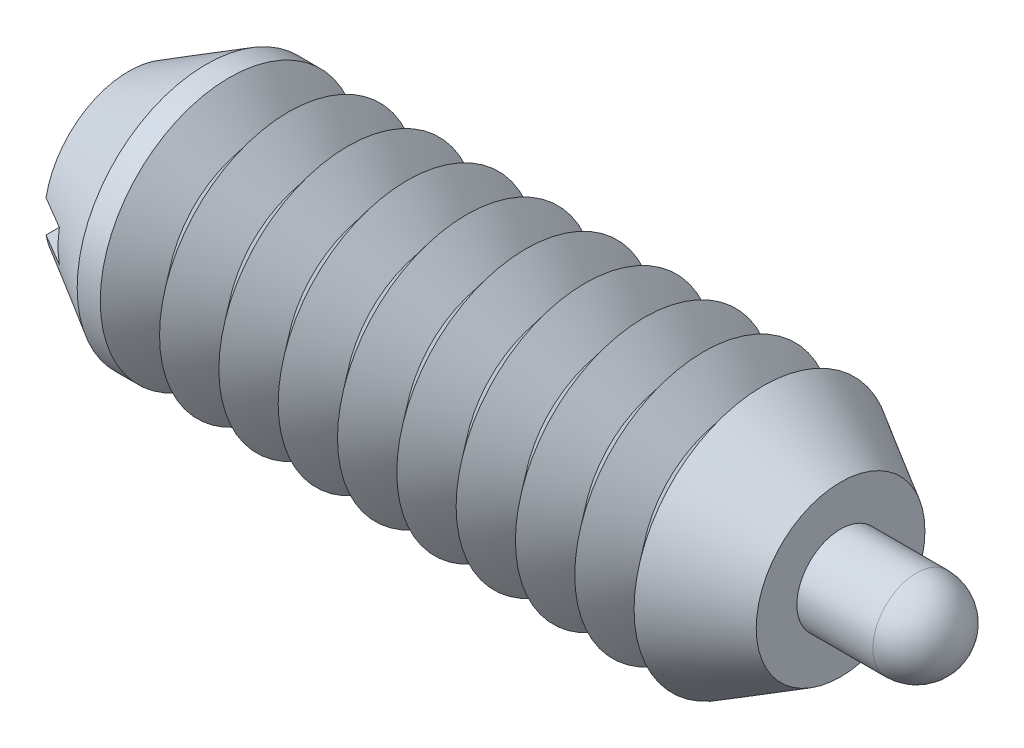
ISO-10303-21;
HEADER;
FILE_DESCRIPTION(('STEP AP214'),'2;1');
FILE_NAME('part.step','',(''),(''),'','','');
FILE_SCHEMA(('AUTOMOTIVE_DESIGN { 1 0 10303 214 1 1 1 1 }'));
ENDSEC;
DATA;
#1=APPLICATION_CONTEXT('core data for automotive mechanical design processes');
#2=APPLICATION_PROTOCOL_DEFINITION('international standard','automotive_design',2000,#1);
#3=PRODUCT_CONTEXT('',#1,'mechanical');
#4=PRODUCT('Part','Part','',(#3));
#5=PRODUCT_RELATED_PRODUCT_CATEGORY('part','',(#4));
#6=PRODUCT_DEFINITION_FORMATION('','',#4);
#7=PRODUCT_DEFINITION_CONTEXT('part definition',#1,'design');
#8=PRODUCT_DEFINITION('design','',#6,#7);
#9=PRODUCT_DEFINITION_SHAPE('','',#8);
#10=(LENGTH_UNIT() NAMED_UNIT(*) SI_UNIT(.MILLI.,.METRE.));
#11=(NAMED_UNIT(*) PLANE_ANGLE_UNIT() SI_UNIT($,.RADIAN.));
#12=(NAMED_UNIT(*) SI_UNIT($,.STERADIAN.) SOLID_ANGLE_UNIT());
#13=UNCERTAINTY_MEASURE_WITH_UNIT(LENGTH_MEASURE(1.E-05),#10,'distance_accuracy_value','');
#14=(GEOMETRIC_REPRESENTATION_CONTEXT(3) GLOBAL_UNCERTAINTY_ASSIGNED_CONTEXT((#13)) GLOBAL_UNIT_ASSIGNED_CONTEXT((#10,
#11,#12)) REPRESENTATION_CONTEXT('',''));
#15=CARTESIAN_POINT('',(0.,0.,0.));
#16=DIRECTION('',(0.,0.,1.));
#17=DIRECTION('',(1.,0.,0.));
#18=AXIS2_PLACEMENT_3D('',#15,#16,#17);
#19=CARTESIAN_POINT('',(8.18134,0.,0.));
#20=DIRECTION('',(-1.,0.,0.));
#21=DIRECTION('',(0.,-0.719424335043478,-0.694570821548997));
#22=AXIS2_PLACEMENT_3D('',#19,#20,#21);
#23=PLANE('',#22);
#24=CARTESIAN_POINT('',(8.18134,0.,0.));
#25=DIRECTION('',(1.,0.,0.));
#26=DIRECTION('',(0.,0.719424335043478,0.694570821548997));
#27=AXIS2_PLACEMENT_3D('',#24,#25,#26);
#28=CIRCLE('',#27,0.5842);
#29=CARTESIAN_POINT('',(8.18134,0.4202876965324,0.405768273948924));
#30=VERTEX_POINT('',#29);
#31=EDGE_CURVE('P0_E10',#30,#30,#28,.T.);
#32=ORIENTED_EDGE('',*,*,#31,.F.);
#33=EDGE_LOOP('',(#32));
#34=FACE_BOUND('',#33,.T.);
#35=ADVANCED_FACE('P0_F14',(#34),#23,.T.);
#36=CARTESIAN_POINT('',(8.29818,0.,0.));
#37=DIRECTION('',(1.,0.,0.));
#38=DIRECTION('',(0.,0.719424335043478,0.694570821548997));
#39=AXIS2_PLACEMENT_3D('',#36,#37,#38);
#40=CONICAL_SURFACE('',#39,0.70104,0.785398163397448);
#41=ORIENTED_EDGE('',*,*,#31,.T.);
#42=EDGE_LOOP('',(#41));
#43=FACE_BOUND('',#42,.T.);
#44=CARTESIAN_POINT('',(8.29818,0.,0.));
#45=DIRECTION('',(1.,0.,0.));
#46=DIRECTION('',(0.,0.719424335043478,0.694570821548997));
#47=AXIS2_PLACEMENT_3D('',#44,#45,#46);
#48=CIRCLE('',#47,0.70104);
#49=CARTESIAN_POINT('',(8.29818,0.50434523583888,0.486921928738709));
#50=VERTEX_POINT('',#49);
#51=EDGE_CURVE('P0_E20',#50,#50,#48,.T.);
#52=ORIENTED_EDGE('',*,*,#51,.F.);
#53=EDGE_LOOP('',(#52));
#54=FACE_BOUND('',#53,.T.);
#55=ADVANCED_FACE('P0_F54',(#43,#54),#40,.T.);
#56=CARTESIAN_POINT('',(11.1252,0.,0.));
#57=DIRECTION('',(1.,0.,0.));
#58=DIRECTION('',(0.,0.719424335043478,0.694570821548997));
#59=AXIS2_PLACEMENT_3D('',#56,#57,#58);
#60=CYLINDRICAL_SURFACE('',#59,0.70104);
#61=ORIENTED_EDGE('',*,*,#51,.T.);
#62=EDGE_LOOP('',(#61));
#63=FACE_BOUND('',#62,.T.);
#64=CARTESIAN_POINT('',(9.14736718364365,0.,0.));
#65=DIRECTION('',(1.,0.,0.));
#66=DIRECTION('',(0.,0.719424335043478,0.694570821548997));
#67=AXIS2_PLACEMENT_3D('',#64,#65,#66);
#68=CIRCLE('',#67,0.70104);
#69=CARTESIAN_POINT('',(9.14736718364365,0.50434523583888,0.486921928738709));
#70=VERTEX_POINT('',#69);
#71=EDGE_CURVE('P0_E24',#70,#70,#68,.T.);
#72=ORIENTED_EDGE('',*,*,#71,.F.);
#73=EDGE_LOOP('',(#72));
#74=FACE_BOUND('',#73,.T.);
#75=ADVANCED_FACE('P0_F50',(#63,#74),#60,.T.);
#76=CARTESIAN_POINT('',(9.34974,0.,0.));
#77=DIRECTION('',(-1.,0.,0.));
#78=DIRECTION('',(0.,-0.719424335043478,-0.694570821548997));
#79=AXIS2_PLACEMENT_3D('',#76,#77,#78);
#80=CONICAL_SURFACE('',#79,0.5842,0.523598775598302);
#81=ORIENTED_EDGE('',*,*,#71,.T.);
#82=EDGE_LOOP('',(#81));
#83=FACE_BOUND('',#82,.T.);
#84=CARTESIAN_POINT('',(9.34974,0.,0.));
#85=DIRECTION('',(1.,0.,0.));
#86=DIRECTION('',(0.,0.719424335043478,0.694570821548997));
#87=AXIS2_PLACEMENT_3D('',#84,#85,#86);
#88=CIRCLE('',#87,0.5842);
#89=CARTESIAN_POINT('',(9.34974,0.4202876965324,0.405768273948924));
#90=VERTEX_POINT('',#89);
#91=EDGE_CURVE('P0_E28',#90,#90,#88,.T.);
#92=ORIENTED_EDGE('',*,*,#91,.F.);
#93=EDGE_LOOP('',(#92));
#94=FACE_BOUND('',#93,.T.);
#95=ADVANCED_FACE('P0_F41',(#83,#94),#80,.T.);
#96=CARTESIAN_POINT('',(11.1252,0.,0.));
#97=DIRECTION('',(1.,0.,0.));
#98=DIRECTION('',(0.,0.719424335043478,0.694570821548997));
#99=AXIS2_PLACEMENT_3D('',#96,#97,#98);
#100=CYLINDRICAL_SURFACE('',#99,0.5842);
#101=ORIENTED_EDGE('',*,*,#91,.T.);
#102=EDGE_LOOP('',(#101));
#103=FACE_BOUND('',#102,.T.);
#104=CARTESIAN_POINT('',(10.541,0.,0.));
#105=DIRECTION('',(1.,0.,0.));
#106=DIRECTION('',(0.,0.719424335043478,0.694570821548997));
#107=AXIS2_PLACEMENT_3D('',#104,#105,#106);
#108=CIRCLE('',#107,0.5842);
#109=CARTESIAN_POINT('',(10.541,0.4202876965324,0.405768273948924));
#110=VERTEX_POINT('',#109);
#111=EDGE_CURVE('P0_E33',#110,#110,#108,.T.);
#112=ORIENTED_EDGE('',*,*,#111,.F.);
#113=EDGE_LOOP('',(#112));
#114=FACE_BOUND('',#113,.T.);
#115=ADVANCED_FACE('P0_F39',(#103,#114),#100,.T.);
#116=CARTESIAN_POINT('',(10.541,0.,0.));
#117=DIRECTION('',(1.,0.,0.));
#118=DIRECTION('',(0.,-0.719424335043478,-0.694570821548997));
#119=AXIS2_PLACEMENT_3D('',#116,#117,#118);
#120=SPHERICAL_SURFACE('',#119,0.5842);
#121=ORIENTED_EDGE('',*,*,#111,.T.);
#122=EDGE_LOOP('',(#121));
#123=FACE_BOUND('',#122,.T.);
#124=ADVANCED_FACE('P0_F37',(#123),#120,.T.);
#125=CLOSED_SHELL('',(#35,#55,#75,#95,#115,#124));
#126=MANIFOLD_SOLID_BREP('P0_B1',#125);
#127=CARTESIAN_POINT('',(9.525,0.,0.));
#128=DIRECTION('',(1.,0.,0.));
#129=DIRECTION('',(0.,0.,-1.));
#130=AXIS2_PLACEMENT_3D('',#127,#128,#129);
#131=PLANE('',#130);
#132=CARTESIAN_POINT('',(9.525,0.,0.));
#133=DIRECTION('',(1.,0.,0.));
#134=DIRECTION('',(0.,0.,-1.));
#135=AXIS2_PLACEMENT_3D('',#132,#133,#134);
#136=CIRCLE('',#135,1.12888036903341);
#137=CARTESIAN_POINT('',(9.525,0.,-1.12888036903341));
#138=VERTEX_POINT('',#137);
#139=EDGE_CURVE('P1_E81',#138,#138,#136,.T.);
#140=ORIENTED_EDGE('',*,*,#139,.T.);
#141=EDGE_LOOP('',(#140));
#142=FACE_BOUND('',#141,.T.);
#143=CARTESIAN_POINT('',(9.525,0.,0.));
#144=DIRECTION('',(-1.,0.,0.));
#145=DIRECTION('',(0.,0.,1.));
#146=AXIS2_PLACEMENT_3D('',#143,#144,#145);
#147=CIRCLE('',#146,0.5842);
#148=CARTESIAN_POINT('',(9.525,0.,0.5842));
#149=VERTEX_POINT('',#148);
#150=EDGE_CURVE('P1_E68',#149,#149,#147,.T.);
#151=ORIENTED_EDGE('',*,*,#150,.T.);
#152=EDGE_LOOP('',(#151));
#153=FACE_BOUND('',#152,.T.);
#154=ADVANCED_FACE('P1_F15',(#142,#153),#131,.T.);
#155=CARTESIAN_POINT('',(9.525,0.,0.));
#156=DIRECTION('',(-1.,0.,0.));
#157=DIRECTION('',(0.,0.,1.));
#158=AXIS2_PLACEMENT_3D('',#155,#156,#157);
#159=CONICAL_SURFACE('',#158,1.12888036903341,0.523598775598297);
#160=CARTESIAN_POINT('',(8.48868000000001,0.,0.));
#161=DIRECTION('',(-1.,0.,0.));
#162=DIRECTION('',(0.,0.,1.));
#163=AXIS2_PLACEMENT_3D('',#160,#161,#162);
#164=CIRCLE('',#163,1.7272);
#165=CARTESIAN_POINT('',(8.48868000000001,0.,1.7272));
#166=VERTEX_POINT('',#165);
#167=EDGE_CURVE('P1_E175',#166,#166,#164,.T.);
#168=ORIENTED_EDGE('',*,*,#167,.F.);
#169=EDGE_LOOP('',(#168));
#170=FACE_BOUND('',#169,.T.);
#171=ORIENTED_EDGE('',*,*,#139,.F.);
#172=EDGE_LOOP('',(#171));
#173=FACE_BOUND('',#172,.T.);
#174=ADVANCED_FACE('P1_F17',(#170,#173),#159,.T.);
#175=CARTESIAN_POINT('',(0.,0.,0.));
#176=DIRECTION('',(-1.,0.,0.));
#177=DIRECTION('',(0.,0.,1.));
#178=AXIS2_PLACEMENT_3D('',#175,#176,#177);
#179=CYLINDRICAL_SURFACE('',#178,0.5842);
#180=CARTESIAN_POINT('',(9.34974,0.,0.));
#181=DIRECTION('',(-1.,0.,0.));
#182=DIRECTION('',(0.,0.,1.));
#183=AXIS2_PLACEMENT_3D('',#180,#181,#182);
#184=CIRCLE('',#183,0.5842);
#185=CARTESIAN_POINT('',(9.34974,0.,0.5842));
#186=VERTEX_POINT('',#185);
#187=EDGE_CURVE('P1_E187',#186,#186,#184,.T.);
#188=ORIENTED_EDGE('',*,*,#187,.T.);
#189=EDGE_LOOP('',(#188));
#190=FACE_BOUND('',#189,.T.);
#191=ORIENTED_EDGE('',*,*,#150,.F.);
#192=EDGE_LOOP('',(#191));
#193=FACE_BOUND('',#192,.T.);
#194=ADVANCED_FACE('P1_F452',(#190,#193),#179,.F.);
#195=CARTESIAN_POINT('',(9.34974,0.,0.));
#196=DIRECTION('',(-1.,0.,0.));
#197=DIRECTION('',(0.,0.,1.));
#198=AXIS2_PLACEMENT_3D('',#195,#196,#197);
#199=CONICAL_SURFACE('',#198,0.5842,0.785398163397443);
#200=CARTESIAN_POINT('',(9.2329,0.,0.));
#201=DIRECTION('',(-1.,0.,0.));
#202=DIRECTION('',(0.,0.,1.));
#203=AXIS2_PLACEMENT_3D('',#200,#201,#202);
#204=CIRCLE('',#203,0.701040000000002);
#205=CARTESIAN_POINT('',(9.2329,0.,0.701040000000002));
#206=VERTEX_POINT('',#205);
#207=EDGE_CURVE('P1_E184',#206,#206,#204,.T.);
#208=ORIENTED_EDGE('',*,*,#207,.T.);
#209=EDGE_LOOP('',(#208));
#210=FACE_BOUND('',#209,.T.);
#211=ORIENTED_EDGE('',*,*,#187,.F.);
#212=EDGE_LOOP('',(#211));
#213=FACE_BOUND('',#212,.T.);
#214=ADVANCED_FACE('P1_F442',(#210,#213),#199,.F.);
#215=CARTESIAN_POINT('',(0.,0.,0.));
#216=DIRECTION('',(-1.,0.,0.));
#217=DIRECTION('',(0.,0.,1.));
#218=AXIS2_PLACEMENT_3D('',#215,#216,#217);
#219=CYLINDRICAL_SURFACE('',#218,0.701040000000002);
#220=CARTESIAN_POINT('',(1.2954,0.,0.));
#221=DIRECTION('',(-1.,0.,0.));
#222=DIRECTION('',(0.,0.,1.));
#223=AXIS2_PLACEMENT_3D('',#220,#221,#222);
#224=CIRCLE('',#223,0.701040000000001);
#225=CARTESIAN_POINT('',(1.2954,0.,0.701040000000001));
#226=VERTEX_POINT('',#225);
#227=EDGE_CURVE('P1_E181',#226,#226,#224,.T.);
#228=ORIENTED_EDGE('',*,*,#227,.T.);
#229=EDGE_LOOP('',(#228));
#230=FACE_BOUND('',#229,.T.);
#231=ORIENTED_EDGE('',*,*,#207,.F.);
#232=EDGE_LOOP('',(#231));
#233=FACE_BOUND('',#232,.T.);
#234=ADVANCED_FACE('P1_F432',(#230,#233),#219,.F.);
#235=CARTESIAN_POINT('',(1.2954,0.,0.));
#236=DIRECTION('',(1.,0.,0.));
#237=DIRECTION('',(0.,0.,-1.));
#238=AXIS2_PLACEMENT_3D('',#235,#236,#237);
#239=PLANE('',#238);
#240=ORIENTED_EDGE('',*,*,#227,.F.);
#241=EDGE_LOOP('',(#240));
#242=FACE_BOUND('',#241,.T.);
#243=ADVANCED_FACE('P1_F422',(#242),#239,.T.);
#244=CARTESIAN_POINT('',(8.09180500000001,0.,0.));
#245=DIRECTION('',(1.,0.,0.));
#246=DIRECTION('',(0.,0.,-1.));
#247=AXIS2_PLACEMENT_3D('',#244,#245,#246);
#248=CONICAL_SURFACE('',#247,1.23150328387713,0.895664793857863);
#249=ORIENTED_EDGE('',*,*,#167,.T.);
#250=EDGE_LOOP('',(#249));
#251=FACE_BOUND('',#250,.T.);
#252=CARTESIAN_POINT('',(8.09180500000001,0.,0.));
#253=DIRECTION('',(-1.,0.,0.));
#254=DIRECTION('',(0.,0.,1.));
#255=AXIS2_PLACEMENT_3D('',#252,#253,#254);
#256=CIRCLE('',#255,1.23150328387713);
#257=CARTESIAN_POINT('',(8.09180500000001,0.,1.23150328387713));
#258=VERTEX_POINT('',#257);
#259=EDGE_CURVE('P1_E178',#258,#258,#256,.T.);
#260=ORIENTED_EDGE('',*,*,#259,.F.);
#261=EDGE_LOOP('',(#260));
#262=FACE_BOUND('',#261,.T.);
#263=ADVANCED_FACE('P1_F412',(#251,#262),#248,.T.);
#264=CARTESIAN_POINT('',(7.69493000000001,0.,0.));
#265=DIRECTION('',(-1.,0.,0.));
#266=DIRECTION('',(0.,0.,1.));
#267=AXIS2_PLACEMENT_3D('',#264,#265,#266);
#268=CONICAL_SURFACE('',#267,1.7272,0.895664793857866);
#269=ORIENTED_EDGE('',*,*,#259,.T.);
#270=EDGE_LOOP('',(#269));
#271=FACE_BOUND('',#270,.T.);
#272=CARTESIAN_POINT('',(7.69493000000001,0.,0.));
#273=DIRECTION('',(-1.,0.,0.));
#274=DIRECTION('',(0.,0.,1.));
#275=AXIS2_PLACEMENT_3D('',#272,#273,#274);
#276=CIRCLE('',#275,1.7272);
#277=CARTESIAN_POINT('',(7.69493000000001,0.,1.7272));
#278=VERTEX_POINT('',#277);
#279=EDGE_CURVE('P1_E169',#278,#278,#276,.T.);
#280=ORIENTED_EDGE('',*,*,#279,.F.);
#281=EDGE_LOOP('',(#280));
#282=FACE_BOUND('',#281,.T.);
#283=ADVANCED_FACE('P1_F402',(#271,#282),#268,.T.);
#284=CARTESIAN_POINT('',(7.29805500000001,0.,0.));
#285=DIRECTION('',(1.,0.,0.));
#286=DIRECTION('',(0.,0.,-1.));
#287=AXIS2_PLACEMENT_3D('',#284,#285,#286);
#288=CONICAL_SURFACE('',#287,1.23150328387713,0.895664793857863);
#289=ORIENTED_EDGE('',*,*,#279,.T.);
#290=EDGE_LOOP('',(#289));
#291=FACE_BOUND('',#290,.T.);
#292=CARTESIAN_POINT('',(7.29805500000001,0.,0.));
#293=DIRECTION('',(-1.,0.,0.));
#294=DIRECTION('',(0.,0.,1.));
#295=AXIS2_PLACEMENT_3D('',#292,#293,#294);
#296=CIRCLE('',#295,1.23150328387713);
#297=CARTESIAN_POINT('',(7.29805500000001,0.,1.23150328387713));
#298=VERTEX_POINT('',#297);
#299=EDGE_CURVE('P1_E172',#298,#298,#296,.T.);
#300=ORIENTED_EDGE('',*,*,#299,.F.);
#301=EDGE_LOOP('',(#300));
#302=FACE_BOUND('',#301,.T.);
#303=ADVANCED_FACE('P1_F392',(#291,#302),#288,.T.);
#304=CARTESIAN_POINT('',(6.90118000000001,0.,0.));
#305=DIRECTION('',(-1.,0.,0.));
#306=DIRECTION('',(0.,0.,1.));
#307=AXIS2_PLACEMENT_3D('',#304,#305,#306);
#308=CONICAL_SURFACE('',#307,1.7272,0.895664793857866);
#309=ORIENTED_EDGE('',*,*,#299,.T.);
#310=EDGE_LOOP('',(#309));
#311=FACE_BOUND('',#310,.T.);
#312=CARTESIAN_POINT('',(6.90118000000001,0.,0.));
#313=DIRECTION('',(-1.,0.,0.));
#314=DIRECTION('',(0.,0.,1.));
#315=AXIS2_PLACEMENT_3D('',#312,#313,#314);
#316=CIRCLE('',#315,1.7272);
#317=CARTESIAN_POINT('',(6.90118000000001,0.,1.7272));
#318=VERTEX_POINT('',#317);
#319=EDGE_CURVE('P1_E163',#318,#318,#316,.T.);
#320=ORIENTED_EDGE('',*,*,#319,.F.);
#321=EDGE_LOOP('',(#320));
#322=FACE_BOUND('',#321,.T.);
#323=ADVANCED_FACE('P1_F382',(#311,#322),#308,.T.);
#324=CARTESIAN_POINT('',(6.50430500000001,0.,0.));
#325=DIRECTION('',(1.,0.,0.));
#326=DIRECTION('',(0.,0.,-1.));
#327=AXIS2_PLACEMENT_3D('',#324,#325,#326);
#328=CONICAL_SURFACE('',#327,1.23150328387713,0.895664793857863);
#329=ORIENTED_EDGE('',*,*,#319,.T.);
#330=EDGE_LOOP('',(#329));
#331=FACE_BOUND('',#330,.T.);
#332=CARTESIAN_POINT('',(6.50430500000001,0.,0.));
#333=DIRECTION('',(-1.,0.,0.));
#334=DIRECTION('',(0.,0.,1.));
#335=AXIS2_PLACEMENT_3D('',#332,#333,#334);
#336=CIRCLE('',#335,1.23150328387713);
#337=CARTESIAN_POINT('',(6.50430500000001,0.,1.23150328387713));
#338=VERTEX_POINT('',#337);
#339=EDGE_CURVE('P1_E166',#338,#338,#336,.T.);
#340=ORIENTED_EDGE('',*,*,#339,.F.);
#341=EDGE_LOOP('',(#340));
#342=FACE_BOUND('',#341,.T.);
#343=ADVANCED_FACE('P1_F372',(#331,#342),#328,.T.);
#344=CARTESIAN_POINT('',(6.10743000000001,0.,0.));
#345=DIRECTION('',(-1.,0.,0.));
#346=DIRECTION('',(0.,0.,1.));
#347=AXIS2_PLACEMENT_3D('',#344,#345,#346);
#348=CONICAL_SURFACE('',#347,1.7272,0.895664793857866);
#349=ORIENTED_EDGE('',*,*,#339,.T.);
#350=EDGE_LOOP('',(#349));
#351=FACE_BOUND('',#350,.T.);
#352=CARTESIAN_POINT('',(6.10743000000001,0.,0.));
#353=DIRECTION('',(-1.,0.,0.));
#354=DIRECTION('',(0.,0.,1.));
#355=AXIS2_PLACEMENT_3D('',#352,#353,#354);
#356=CIRCLE('',#355,1.7272);
#357=CARTESIAN_POINT('',(6.10743000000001,0.,1.7272));
#358=VERTEX_POINT('',#357);
#359=EDGE_CURVE('P1_E157',#358,#358,#356,.T.);
#360=ORIENTED_EDGE('',*,*,#359,.F.);
#361=EDGE_LOOP('',(#360));
#362=FACE_BOUND('',#361,.T.);
#363=ADVANCED_FACE('P1_F362',(#351,#362),#348,.T.);
#364=CARTESIAN_POINT('',(5.71055500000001,0.,0.));
#365=DIRECTION('',(1.,0.,0.));
#366=DIRECTION('',(0.,0.,-1.));
#367=AXIS2_PLACEMENT_3D('',#364,#365,#366);
#368=CONICAL_SURFACE('',#367,1.23150328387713,0.895664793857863);
#369=ORIENTED_EDGE('',*,*,#359,.T.);
#370=EDGE_LOOP('',(#369));
#371=FACE_BOUND('',#370,.T.);
#372=CARTESIAN_POINT('',(5.71055500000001,0.,0.));
#373=DIRECTION('',(-1.,0.,0.));
#374=DIRECTION('',(0.,0.,1.));
#375=AXIS2_PLACEMENT_3D('',#372,#373,#374);
#376=CIRCLE('',#375,1.23150328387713);
#377=CARTESIAN_POINT('',(5.71055500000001,0.,1.23150328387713));
#378=VERTEX_POINT('',#377);
#379=EDGE_CURVE('P1_E160',#378,#378,#376,.T.);
#380=ORIENTED_EDGE('',*,*,#379,.F.);
#381=EDGE_LOOP('',(#380));
#382=FACE_BOUND('',#381,.T.);
#383=ADVANCED_FACE('P1_F352',(#371,#382),#368,.T.);
#384=CARTESIAN_POINT('',(5.31368000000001,0.,0.));
#385=DIRECTION('',(-1.,0.,0.));
#386=DIRECTION('',(0.,0.,1.));
#387=AXIS2_PLACEMENT_3D('',#384,#385,#386);
#388=CONICAL_SURFACE('',#387,1.7272,0.895664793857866);
#389=ORIENTED_EDGE('',*,*,#379,.T.);
#390=EDGE_LOOP('',(#389));
#391=FACE_BOUND('',#390,.T.);
#392=CARTESIAN_POINT('',(5.31368000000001,0.,0.));
#393=DIRECTION('',(-1.,0.,0.));
#394=DIRECTION('',(0.,0.,1.));
#395=AXIS2_PLACEMENT_3D('',#392,#393,#394);
#396=CIRCLE('',#395,1.7272);
#397=CARTESIAN_POINT('',(5.31368000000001,0.,1.7272));
#398=VERTEX_POINT('',#397);
#399=EDGE_CURVE('P1_E151',#398,#398,#396,.T.);
#400=ORIENTED_EDGE('',*,*,#399,.F.);
#401=EDGE_LOOP('',(#400));
#402=FACE_BOUND('',#401,.T.);
#403=ADVANCED_FACE('P1_F342',(#391,#402),#388,.T.);
#404=CARTESIAN_POINT('',(4.91680500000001,0.,0.));
#405=DIRECTION('',(1.,0.,0.));
#406=DIRECTION('',(0.,0.,-1.));
#407=AXIS2_PLACEMENT_3D('',#404,#405,#406);
#408=CONICAL_SURFACE('',#407,1.23150328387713,0.895664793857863);
#409=ORIENTED_EDGE('',*,*,#399,.T.);
#410=EDGE_LOOP('',(#409));
#411=FACE_BOUND('',#410,.T.);
#412=CARTESIAN_POINT('',(4.91680500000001,0.,0.));
#413=DIRECTION('',(-1.,0.,0.));
#414=DIRECTION('',(0.,0.,1.));
#415=AXIS2_PLACEMENT_3D('',#412,#413,#414);
#416=CIRCLE('',#415,1.23150328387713);
#417=CARTESIAN_POINT('',(4.91680500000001,0.,1.23150328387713));
#418=VERTEX_POINT('',#417);
#419=EDGE_CURVE('P1_E154',#418,#418,#416,.T.);
#420=ORIENTED_EDGE('',*,*,#419,.F.);
#421=EDGE_LOOP('',(#420));
#422=FACE_BOUND('',#421,.T.);
#423=ADVANCED_FACE('P1_F332',(#411,#422),#408,.T.);
#424=CARTESIAN_POINT('',(4.51993000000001,0.,0.));
#425=DIRECTION('',(-1.,0.,0.));
#426=DIRECTION('',(0.,0.,1.));
#427=AXIS2_PLACEMENT_3D('',#424,#425,#426);
#428=CONICAL_SURFACE('',#427,1.7272,0.895664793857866);
#429=ORIENTED_EDGE('',*,*,#419,.T.);
#430=EDGE_LOOP('',(#429));
#431=FACE_BOUND('',#430,.T.);
#432=CARTESIAN_POINT('',(4.51993000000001,0.,0.));
#433=DIRECTION('',(-1.,0.,0.));
#434=DIRECTION('',(0.,0.,1.));
#435=AXIS2_PLACEMENT_3D('',#432,#433,#434);
#436=CIRCLE('',#435,1.7272);
#437=CARTESIAN_POINT('',(4.51993000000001,0.,1.7272));
#438=VERTEX_POINT('',#437);
#439=EDGE_CURVE('P1_E145',#438,#438,#436,.T.);
#440=ORIENTED_EDGE('',*,*,#439,.F.);
#441=EDGE_LOOP('',(#440));
#442=FACE_BOUND('',#441,.T.);
#443=ADVANCED_FACE('P1_F322',(#431,#442),#428,.T.);
#444=CARTESIAN_POINT('',(4.12305500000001,0.,0.));
#445=DIRECTION('',(1.,0.,0.));
#446=DIRECTION('',(0.,0.,-1.));
#447=AXIS2_PLACEMENT_3D('',#444,#445,#446);
#448=CONICAL_SURFACE('',#447,1.23150328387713,0.895664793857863);
#449=ORIENTED_EDGE('',*,*,#439,.T.);
#450=EDGE_LOOP('',(#449));
#451=FACE_BOUND('',#450,.T.);
#452=CARTESIAN_POINT('',(4.12305500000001,0.,0.));
#453=DIRECTION('',(-1.,0.,0.));
#454=DIRECTION('',(0.,0.,1.));
#455=AXIS2_PLACEMENT_3D('',#452,#453,#454);
#456=CIRCLE('',#455,1.23150328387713);
#457=CARTESIAN_POINT('',(4.12305500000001,0.,1.23150328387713));
#458=VERTEX_POINT('',#457);
#459=EDGE_CURVE('P1_E148',#458,#458,#456,.T.);
#460=ORIENTED_EDGE('',*,*,#459,.F.);
#461=EDGE_LOOP('',(#460));
#462=FACE_BOUND('',#461,.T.);
#463=ADVANCED_FACE('P1_F312',(#451,#462),#448,.T.);
#464=CARTESIAN_POINT('',(3.72618000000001,0.,0.));
#465=DIRECTION('',(-1.,0.,0.));
#466=DIRECTION('',(0.,0.,1.));
#467=AXIS2_PLACEMENT_3D('',#464,#465,#466);
#468=CONICAL_SURFACE('',#467,1.7272,0.895664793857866);
#469=ORIENTED_EDGE('',*,*,#459,.T.);
#470=EDGE_LOOP('',(#469));
#471=FACE_BOUND('',#470,.T.);
#472=CARTESIAN_POINT('',(3.72618000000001,0.,0.));
#473=DIRECTION('',(-1.,0.,0.));
#474=DIRECTION('',(0.,0.,1.));
#475=AXIS2_PLACEMENT_3D('',#472,#473,#474);
#476=CIRCLE('',#475,1.7272);
#477=CARTESIAN_POINT('',(3.72618000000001,0.,1.7272));
#478=VERTEX_POINT('',#477);
#479=EDGE_CURVE('P1_E139',#478,#478,#476,.T.);
#480=ORIENTED_EDGE('',*,*,#479,.F.);
#481=EDGE_LOOP('',(#480));
#482=FACE_BOUND('',#481,.T.);
#483=ADVANCED_FACE('P1_F302',(#471,#482),#468,.T.);
#484=CARTESIAN_POINT('',(3.32930500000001,0.,0.));
#485=DIRECTION('',(1.,0.,0.));
#486=DIRECTION('',(0.,0.,-1.));
#487=AXIS2_PLACEMENT_3D('',#484,#485,#486);
#488=CONICAL_SURFACE('',#487,1.23150328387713,0.895664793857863);
#489=ORIENTED_EDGE('',*,*,#479,.T.);
#490=EDGE_LOOP('',(#489));
#491=FACE_BOUND('',#490,.T.);
#492=CARTESIAN_POINT('',(3.32930500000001,0.,0.));
#493=DIRECTION('',(-1.,0.,0.));
#494=DIRECTION('',(0.,0.,1.));
#495=AXIS2_PLACEMENT_3D('',#492,#493,#494);
#496=CIRCLE('',#495,1.23150328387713);
#497=CARTESIAN_POINT('',(3.32930500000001,0.,1.23150328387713));
#498=VERTEX_POINT('',#497);
#499=EDGE_CURVE('P1_E142',#498,#498,#496,.T.);
#500=ORIENTED_EDGE('',*,*,#499,.F.);
#501=EDGE_LOOP('',(#500));
#502=FACE_BOUND('',#501,.T.);
#503=ADVANCED_FACE('P1_F292',(#491,#502),#488,.T.);
#504=CARTESIAN_POINT('',(2.93243000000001,0.,0.));
#505=DIRECTION('',(-1.,0.,0.));
#506=DIRECTION('',(0.,0.,1.));
#507=AXIS2_PLACEMENT_3D('',#504,#505,#506);
#508=CONICAL_SURFACE('',#507,1.7272,0.895664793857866);
#509=ORIENTED_EDGE('',*,*,#499,.T.);
#510=EDGE_LOOP('',(#509));
#511=FACE_BOUND('',#510,.T.);
#512=CARTESIAN_POINT('',(2.93243000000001,0.,0.));
#513=DIRECTION('',(-1.,0.,0.));
#514=DIRECTION('',(0.,0.,1.));
#515=AXIS2_PLACEMENT_3D('',#512,#513,#514);
#516=CIRCLE('',#515,1.7272);
#517=CARTESIAN_POINT('',(2.93243000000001,0.,1.7272));
#518=VERTEX_POINT('',#517);
#519=EDGE_CURVE('P1_E129',#518,#518,#516,.T.);
#520=ORIENTED_EDGE('',*,*,#519,.F.);
#521=EDGE_LOOP('',(#520));
#522=FACE_BOUND('',#521,.T.);
#523=ADVANCED_FACE('P1_F282',(#511,#522),#508,.T.);
#524=CARTESIAN_POINT('',(2.53555500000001,0.,0.));
#525=DIRECTION('',(1.,0.,0.));
#526=DIRECTION('',(0.,0.,-1.));
#527=AXIS2_PLACEMENT_3D('',#524,#525,#526);
#528=CONICAL_SURFACE('',#527,1.23150328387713,0.895664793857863);
#529=ORIENTED_EDGE('',*,*,#519,.T.);
#530=EDGE_LOOP('',(#529));
#531=FACE_BOUND('',#530,.T.);
#532=CARTESIAN_POINT('',(2.53555500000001,0.,0.));
#533=DIRECTION('',(-1.,0.,0.));
#534=DIRECTION('',(0.,0.,1.));
#535=AXIS2_PLACEMENT_3D('',#532,#533,#534);
#536=CIRCLE('',#535,1.23150328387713);
#537=CARTESIAN_POINT('',(2.53555500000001,0.,1.23150328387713));
#538=VERTEX_POINT('',#537);
#539=EDGE_CURVE('P1_E136',#538,#538,#536,.T.);
#540=ORIENTED_EDGE('',*,*,#539,.F.);
#541=EDGE_LOOP('',(#540));
#542=FACE_BOUND('',#541,.T.);
#543=ADVANCED_FACE('P1_F272',(#531,#542),#528,.T.);
#544=CARTESIAN_POINT('',(2.13868000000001,0.,0.));
#545=DIRECTION('',(-1.,0.,0.));
#546=DIRECTION('',(0.,0.,1.));
#547=AXIS2_PLACEMENT_3D('',#544,#545,#546);
#548=CONICAL_SURFACE('',#547,1.7272,0.895664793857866);
#549=ORIENTED_EDGE('',*,*,#539,.T.);
#550=EDGE_LOOP('',(#549));
#551=FACE_BOUND('',#550,.T.);
#552=CARTESIAN_POINT('',(2.13868000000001,0.,0.));
#553=DIRECTION('',(-1.,0.,0.));
#554=DIRECTION('',(0.,0.,1.));
#555=AXIS2_PLACEMENT_3D('',#552,#553,#554);
#556=CIRCLE('',#555,1.7272);
#557=CARTESIAN_POINT('',(2.13868000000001,0.,1.7272));
#558=VERTEX_POINT('',#557);
#559=EDGE_CURVE('P1_E126',#558,#558,#556,.T.);
#560=ORIENTED_EDGE('',*,*,#559,.F.);
#561=EDGE_LOOP('',(#560));
#562=FACE_BOUND('',#561,.T.);
#563=ADVANCED_FACE('P1_F262',(#551,#562),#548,.T.);
#564=CARTESIAN_POINT('',(1.74180500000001,0.,0.));
#565=DIRECTION('',(1.,0.,0.));
#566=DIRECTION('',(0.,0.,-1.));
#567=AXIS2_PLACEMENT_3D('',#564,#565,#566);
#568=CONICAL_SURFACE('',#567,1.23150328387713,0.895664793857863);
#569=ORIENTED_EDGE('',*,*,#559,.T.);
#570=EDGE_LOOP('',(#569));
#571=FACE_BOUND('',#570,.T.);
#572=CARTESIAN_POINT('',(1.74180500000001,0.,0.));
#573=DIRECTION('',(-1.,0.,0.));
#574=DIRECTION('',(0.,0.,1.));
#575=AXIS2_PLACEMENT_3D('',#572,#573,#574);
#576=CIRCLE('',#575,1.23150328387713);
#577=CARTESIAN_POINT('',(1.74180500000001,0.,1.23150328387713));
#578=VERTEX_POINT('',#577);
#579=EDGE_CURVE('P1_E125',#578,#578,#576,.T.);
#580=ORIENTED_EDGE('',*,*,#579,.F.);
#581=EDGE_LOOP('',(#580));
#582=FACE_BOUND('',#581,.T.);
#583=ADVANCED_FACE('P1_F252',(#571,#582),#568,.T.);
#584=CARTESIAN_POINT('',(1.34493000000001,0.,0.));
#585=DIRECTION('',(-1.,0.,0.));
#586=DIRECTION('',(0.,0.,1.));
#587=AXIS2_PLACEMENT_3D('',#584,#585,#586);
#588=CONICAL_SURFACE('',#587,1.7272,0.895664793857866);
#589=ORIENTED_EDGE('',*,*,#579,.T.);
#590=EDGE_LOOP('',(#589));
#591=FACE_BOUND('',#590,.T.);
#592=CARTESIAN_POINT('',(1.34493000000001,0.,0.));
#593=DIRECTION('',(-1.,0.,0.));
#594=DIRECTION('',(0.,0.,1.));
#595=AXIS2_PLACEMENT_3D('',#592,#593,#594);
#596=CIRCLE('',#595,1.7272);
#597=CARTESIAN_POINT('',(1.34493000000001,0.,1.7272));
#598=VERTEX_POINT('',#597);
#599=EDGE_CURVE('P1_E123',#598,#598,#596,.T.);
#600=ORIENTED_EDGE('',*,*,#599,.F.);
#601=EDGE_LOOP('',(#600));
#602=FACE_BOUND('',#601,.T.);
#603=ADVANCED_FACE('P1_F110',(#591,#602),#588,.T.);
#604=CARTESIAN_POINT('',(0.,0.,0.));
#605=DIRECTION('',(1.,0.,0.));
#606=DIRECTION('',(0.,0.,-1.));
#607=AXIS2_PLACEMENT_3D('',#604,#605,#606);
#608=PLANE('',#607);
#609=CARTESIAN_POINT('',(0.,0.,0.));
#610=DIRECTION('',(1.,0.,0.));
#611=DIRECTION('',(0.,0.,-1.));
#612=AXIS2_PLACEMENT_3D('',#609,#610,#611);
#613=CIRCLE('',#612,1.12888036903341);
#614=CARTESIAN_POINT('',(0.,-0.2159,-1.10804245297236));
#615=VERTEX_POINT('',#614);
#616=CARTESIAN_POINT('',(0.,-0.2159,1.10804245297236));
#617=VERTEX_POINT('',#616);
#618=EDGE_CURVE('P1_E77',#615,#617,#613,.F.);
#619=ORIENTED_EDGE('',*,*,#618,.T.);
#620=DIRECTION('',(0.,0.,1.));
#621=VECTOR('',#620,1.);
#622=CARTESIAN_POINT('',(0.,-0.2159,-1.7272));
#623=LINE('',#622,#621);
#624=EDGE_CURVE('P1_E35',#615,#617,#623,.T.);
#625=ORIENTED_EDGE('',*,*,#624,.F.);
#626=EDGE_LOOP('',(#619,#625));
#627=FACE_BOUND('',#626,.T.);
#628=ADVANCED_FACE('P1_F101',(#627),#608,.F.);
#629=CARTESIAN_POINT('',(0.,-0.2159,-1.7272));
#630=DIRECTION('',(0.,-1.,0.));
#631=DIRECTION('',(0.,0.,-1.));
#632=AXIS2_PLACEMENT_3D('',#629,#630,#631);
#633=PLANE('',#632);
#634=CARTESIAN_POINT('',(2.52076973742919,-0.2159,-2.57521302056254));
#635=CARTESIAN_POINT('',(2.26907100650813,-0.2159,-2.42936283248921));
#636=CARTESIAN_POINT('',(2.01739148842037,-0.2159,-2.28347947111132));
#637=CARTESIAN_POINT('',(1.51411985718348,-0.2159,-1.99144810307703));
#638=CARTESIAN_POINT('',(1.26252777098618,-0.2159,-1.84530004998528));
#639=CARTESIAN_POINT('',(0.766134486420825,-0.2159,-1.55641330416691));
#640=CARTESIAN_POINT('',(0.521327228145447,-0.2159,-1.41368504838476));
#641=CARTESIAN_POINT('',(0.154558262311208,-0.2159,-1.19888559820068));
#642=CARTESIAN_POINT('',(0.0323859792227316,-0.2159,-1.12717407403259));
#643=CARTESIAN_POINT('',(-0.211712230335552,-0.2159,-0.983333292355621));
#644=CARTESIAN_POINT('',(-0.333638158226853,-0.2159,-0.91120403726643));
#645=CARTESIAN_POINT('',(-0.516489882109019,-0.2159,-0.802187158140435));
#646=CARTESIAN_POINT('',(-0.577600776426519,-0.2159,-0.76561020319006));
#647=CARTESIAN_POINT('',(-0.699649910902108,-0.2159,-0.692121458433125));
#648=CARTESIAN_POINT('',(-0.760588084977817,-0.2159,-0.655209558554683));
#649=CARTESIAN_POINT('',(-0.882776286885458,-0.2159,-0.580482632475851));
#650=CARTESIAN_POINT('',(-0.944023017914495,-0.2159,-0.542662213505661));
#651=CARTESIAN_POINT('',(-1.06588953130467,-0.2159,-0.466147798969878));
#652=CARTESIAN_POINT('',(-1.12650988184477,-0.2159,-0.427454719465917));
#653=CARTESIAN_POINT('',(-1.21652495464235,-0.2159,-0.367962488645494));
#654=CARTESIAN_POINT('',(-1.24638993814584,-0.2159,-0.347880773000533));
#655=CARTESIAN_POINT('',(-1.30566636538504,-0.2159,-0.306888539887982));
#656=CARTESIAN_POINT('',(-1.33507634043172,-0.2159,-0.285975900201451));
#657=CARTESIAN_POINT('',(-1.39267749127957,-0.2159,-0.243069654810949));
#658=CARTESIAN_POINT('',(-1.4208779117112,-0.2159,-0.22108894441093));
#659=CARTESIAN_POINT('',(-1.46155161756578,-0.2159,-0.186312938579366));
#660=CARTESIAN_POINT('',(-1.47481212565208,-0.2159,-0.174446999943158));
#661=CARTESIAN_POINT('',(-1.50045016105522,-0.2159,-0.149806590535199));
#662=CARTESIAN_POINT('',(-1.51282906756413,-0.2159,-0.137033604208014));
#663=CARTESIAN_POINT('',(-1.53273895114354,-0.2159,-0.113887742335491));
#664=CARTESIAN_POINT('',(-1.54065414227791,-0.2159,-0.103850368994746));
#665=CARTESIAN_POINT('',(-1.55510063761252,-0.2159,-0.0828292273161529));
#666=CARTESIAN_POINT('',(-1.56163718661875,-0.2159,-0.0718492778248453));
#667=CARTESIAN_POINT('',(-1.57031869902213,-0.2159,-0.0532120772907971));
#668=CARTESIAN_POINT('',(-1.57318609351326,-0.2159,-0.0458986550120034));
#669=CARTESIAN_POINT('',(-1.57773136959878,-0.2159,-0.0309072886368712));
#670=CARTESIAN_POINT('',(-1.57941083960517,-0.2159,-0.0232298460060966));
#671=CARTESIAN_POINT('',(-1.58133938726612,-0.2159,-0.00762162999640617));
#672=CARTESIAN_POINT('',(-1.58157606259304,-0.2159,0.000310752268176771));
#673=CARTESIAN_POINT('',(-1.58054244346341,-0.2159,0.0160744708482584));
#674=CARTESIAN_POINT('',(-1.57927148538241,-0.2159,0.0239057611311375));
#675=CARTESIAN_POINT('',(-1.57503021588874,-0.2159,0.0408376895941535));
#676=CARTESIAN_POINT('',(-1.57175971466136,-0.2159,0.0498606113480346));
#677=CARTESIAN_POINT('',(-1.56385958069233,-0.2159,0.0672912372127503));
#678=CARTESIAN_POINT('',(-1.55922583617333,-0.2159,0.0756969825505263));
#679=CARTESIAN_POINT('',(-1.54754837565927,-0.2159,0.0943298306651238));
#680=CARTESIAN_POINT('',(-1.54019727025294,-0.2159,0.104359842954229));
#681=CARTESIAN_POINT('',(-1.52456878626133,-0.2159,0.123680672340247));
#682=CARTESIAN_POINT('',(-1.51628937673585,-0.2159,0.132969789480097));
#683=CARTESIAN_POINT('',(-1.49908583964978,-0.2159,0.151046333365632));
#684=CARTESIAN_POINT('',(-1.49015765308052,-0.2159,0.159829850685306));
#685=CARTESIAN_POINT('',(-1.4719113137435,-0.2159,0.176956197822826));
#686=CARTESIAN_POINT('',(-1.46259360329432,-0.2159,0.185299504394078));
#687=CARTESIAN_POINT('',(-1.43214775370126,-0.2159,0.211647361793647));
#688=CARTESIAN_POINT('',(-1.41047768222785,-0.2159,0.229022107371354));
#689=CARTESIAN_POINT('',(-1.366425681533,-0.2159,0.262850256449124));
#690=CARTESIAN_POINT('',(-1.34404329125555,-0.2159,0.279303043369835));
#691=CARTESIAN_POINT('',(-1.27618808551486,-0.2159,0.32784450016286));
#692=CARTESIAN_POINT('',(-1.23008782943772,-0.2159,0.359052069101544));
#693=CARTESIAN_POINT('',(-1.13727199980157,-0.2159,0.42028564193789));
#694=CARTESIAN_POINT('',(-1.09055799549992,-0.2159,0.450314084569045));
#695=CARTESIAN_POINT('',(-0.996772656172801,-0.2159,0.509685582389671));
#696=CARTESIAN_POINT('',(-0.949701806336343,-0.2159,0.539029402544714));
#697=CARTESIAN_POINT('',(-0.808685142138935,-0.2159,0.626133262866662));
#698=CARTESIAN_POINT('',(-0.714385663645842,-0.2159,0.6833177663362));
#699=CARTESIAN_POINT('',(-0.525361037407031,-0.2159,0.796982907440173));
#700=CARTESIAN_POINT('',(-0.430635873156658,-0.2159,0.853463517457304));
#701=CARTESIAN_POINT('',(-0.240898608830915,-0.2159,0.966051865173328));
#702=CARTESIAN_POINT('',(-0.145886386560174,-0.2159,1.02215939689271));
#703=CARTESIAN_POINT('',(0.044279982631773,-0.2159,1.13412951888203));
#704=CARTESIAN_POINT('',(0.139434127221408,-0.2159,1.18999211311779));
#705=CARTESIAN_POINT('',(0.42491611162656,-0.2159,1.35727616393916));
#706=CARTESIAN_POINT('',(0.615381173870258,-0.2159,1.46846336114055));
#707=CARTESIAN_POINT('',(0.996459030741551,-0.2159,1.69051904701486));
#708=CARTESIAN_POINT('',(1.1870717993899,-0.2159,1.80138758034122));
#709=CARTESIAN_POINT('',(1.47293646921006,-0.2159,1.96747984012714));
#710=CARTESIAN_POINT('',(1.56814948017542,-0.2159,2.02277049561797));
#711=CARTESIAN_POINT('',(1.75859942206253,-0.2159,2.13331873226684));
#712=CARTESIAN_POINT('',(1.85383635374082,-0.2159,2.18857631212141));
#713=CARTESIAN_POINT('',(2.04435035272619,-0.2159,2.29907763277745));
#714=CARTESIAN_POINT('',(2.13962742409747,-0.2159,2.35432136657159));
#715=CARTESIAN_POINT('',(2.3301912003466,-0.2159,2.46478402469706));
#716=CARTESIAN_POINT('',(2.42547790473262,-0.2159,2.52000294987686));
#717=CARTESIAN_POINT('',(2.52076973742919,-0.2159,2.57521302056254));
#718=B_SPLINE_CURVE_WITH_KNOTS('',3,(#634,#635,#636,#637,#638,#639,#640,#641,#642,#643,#644,
#645,#646,#647,#648,#649,#650,#651,#652,#653,#654,#655,#656,#657,#658,#659,#660,#661,#662,#663,
#664,#665,#666,#667,#668,#669,#670,#671,#672,#673,#674,#675,#676,#677,#678,#679,#680,#681,#682,
#683,#684,#685,#686,#687,#688,#689,#690,#691,#692,#693,#694,#695,#696,#697,#698,#699,#700,#701,
#702,#703,#704,#705,#706,#707,#708,#709,#710,#711,#712,#713,#714,#715,#716,#717),.UNSPECIFIED.,
.F.,.F.,(4,2,2,2,2,2,2,2,2,2,2,2,2,2,2,2,2,2,2,2,2,2,2,2,2,2,2,2,2,2,2,2,2,2,2,2,2,2,2,2,2,4),
(0.,0.872708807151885,1.74558937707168,2.59571598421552,3.02070691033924,3.44569537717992,
3.65935755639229,3.87309269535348,4.08903923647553,4.30476877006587,4.41272561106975,
4.52097856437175,4.62814939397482,4.68151041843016,4.73478604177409,4.77307600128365,
4.81121755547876,4.83470763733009,4.85816625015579,4.88182623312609,4.90549663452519,
4.93412513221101,4.96284087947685,5.00005407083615,5.03735032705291,5.07490425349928,
5.11241663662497,5.19568832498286,5.27901505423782,5.44597717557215,5.61257352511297,
5.77897382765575,6.10981683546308,6.44067278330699,6.77169833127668,7.1027184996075,
7.76434889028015,8.42588154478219,8.75618921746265,9.08650914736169,9.4169124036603,
9.74730333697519),.UNSPECIFIED.);
#719=CARTESIAN_POINT('',(0.4318,-0.2159,-1.36116416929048));
#720=VERTEX_POINT('',#719);
#721=EDGE_CURVE('P1_E93',#720,#615,#718,.T.);
#722=ORIENTED_EDGE('',*,*,#721,.T.);
#723=ORIENTED_EDGE('',*,*,#624,.T.);
#724=CARTESIAN_POINT('',(0.4318,-0.2159,1.36116416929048));
#725=VERTEX_POINT('',#724);
#726=EDGE_CURVE('P1_E88',#617,#725,#718,.T.);
#727=ORIENTED_EDGE('',*,*,#726,.T.);
#728=DIRECTION('',(0.,0.,1.));
#729=VECTOR('',#728,1.);
#730=CARTESIAN_POINT('',(0.4318,-0.2159,-1.7272));
#731=LINE('',#730,#729);
#732=EDGE_CURVE('P1_E193',#720,#725,#731,.T.);
#733=ORIENTED_EDGE('',*,*,#732,.F.);
#734=EDGE_LOOP('',(#722,#723,#727,#733));
#735=FACE_BOUND('',#734,.T.);
#736=ADVANCED_FACE('P1_F96',(#735),#633,.F.);
#737=CARTESIAN_POINT('',(0.4318,0.2159,-1.7272));
#738=DIRECTION('',(1.,0.,0.));
#739=DIRECTION('',(0.,0.,-1.));
#740=AXIS2_PLACEMENT_3D('',#737,#738,#739);
#741=PLANE('',#740);
#742=CARTESIAN_POINT('',(0.4318,0.,0.));
#743=DIRECTION('',(1.,0.,0.));
#744=DIRECTION('',(0.,0.,-1.));
#745=AXIS2_PLACEMENT_3D('',#742,#743,#744);
#746=CIRCLE('',#745,1.37818021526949);
#747=CARTESIAN_POINT('',(0.4318,0.2159,1.36116416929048));
#748=VERTEX_POINT('',#747);
#749=EDGE_CURVE('P1_E43',#725,#748,#746,.F.);
#750=ORIENTED_EDGE('',*,*,#749,.T.);
#751=DIRECTION('',(0.,0.,1.));
#752=VECTOR('',#751,1.);
#753=CARTESIAN_POINT('',(0.4318,0.2159,-1.7272));
#754=LINE('',#753,#752);
#755=CARTESIAN_POINT('',(0.4318,0.2159,-1.36116416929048));
#756=VERTEX_POINT('',#755);
#757=EDGE_CURVE('P1_E83',#756,#748,#754,.T.);
#758=ORIENTED_EDGE('',*,*,#757,.F.);
#759=EDGE_CURVE('P1_E28',#756,#720,#746,.F.);
#760=ORIENTED_EDGE('',*,*,#759,.T.);
#761=ORIENTED_EDGE('',*,*,#732,.T.);
#762=EDGE_LOOP('',(#750,#758,#760,#761));
#763=FACE_BOUND('',#762,.T.);
#764=ADVANCED_FACE('P1_F100',(#763),#741,.F.);
#765=CARTESIAN_POINT('',(0.,0.2159,1.10804245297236));
#766=VERTEX_POINT('',#765);
#767=CARTESIAN_POINT('',(0.,0.2159,-1.10804245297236));
#768=VERTEX_POINT('',#767);
#769=EDGE_CURVE('P1_E74',#766,#768,#613,.F.);
#770=ORIENTED_EDGE('',*,*,#769,.T.);
#771=DIRECTION('',(0.,0.,1.));
#772=VECTOR('',#771,1.);
#773=CARTESIAN_POINT('',(0.,0.2159,-1.7272));
#774=LINE('',#773,#772);
#775=EDGE_CURVE('P1_E61',#768,#766,#774,.T.);
#776=ORIENTED_EDGE('',*,*,#775,.T.);
#777=EDGE_LOOP('',(#770,#776));
#778=FACE_BOUND('',#777,.T.);
#779=ADVANCED_FACE('P1_F76',(#778),#608,.F.);
#780=CARTESIAN_POINT('',(0.,0.2159,-1.7272));
#781=DIRECTION('',(0.,1.,0.));
#782=DIRECTION('',(0.,0.,1.));
#783=AXIS2_PLACEMENT_3D('',#780,#781,#782);
#784=PLANE('',#783);
#785=CARTESIAN_POINT('',(2.5207697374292,0.2159,2.57521302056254));
#786=CARTESIAN_POINT('',(2.26907100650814,0.2159,2.42936283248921));
#787=CARTESIAN_POINT('',(2.01739148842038,0.2159,2.28347947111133));
#788=CARTESIAN_POINT('',(1.51411985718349,0.2159,1.99144810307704));
#789=CARTESIAN_POINT('',(1.26252777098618,0.2159,1.84530004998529));
#790=CARTESIAN_POINT('',(0.766134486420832,0.2159,1.55641330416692));
#791=CARTESIAN_POINT('',(0.521327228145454,0.2159,1.41368504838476));
#792=CARTESIAN_POINT('',(0.154558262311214,0.2159,1.19888559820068));
#793=CARTESIAN_POINT('',(0.0323859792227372,0.2159,1.12717407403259));
#794=CARTESIAN_POINT('',(-0.211712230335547,0.2159,0.983333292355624));
#795=CARTESIAN_POINT('',(-0.333638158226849,0.2159,0.911204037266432));
#796=CARTESIAN_POINT('',(-0.516489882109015,0.2159,0.802187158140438));
#797=CARTESIAN_POINT('',(-0.577600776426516,0.2159,0.765610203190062));
#798=CARTESIAN_POINT('',(-0.699649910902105,0.2159,0.692121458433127));
#799=CARTESIAN_POINT('',(-0.760588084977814,0.2159,0.655209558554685));
#800=CARTESIAN_POINT('',(-0.882776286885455,0.2159,0.580482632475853));
#801=CARTESIAN_POINT('',(-0.944023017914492,0.2159,0.542662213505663));
#802=CARTESIAN_POINT('',(-1.06588953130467,0.2159,0.46614779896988));
#803=CARTESIAN_POINT('',(-1.12650988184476,0.2159,0.427454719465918));
#804=CARTESIAN_POINT('',(-1.21652495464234,0.2159,0.367962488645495));
#805=CARTESIAN_POINT('',(-1.24638993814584,0.2159,0.347880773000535));
#806=CARTESIAN_POINT('',(-1.30566636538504,0.2159,0.306888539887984));
#807=CARTESIAN_POINT('',(-1.33507634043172,0.2159,0.285975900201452));
#808=CARTESIAN_POINT('',(-1.39267749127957,0.2159,0.24306965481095));
#809=CARTESIAN_POINT('',(-1.4208779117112,0.2159,0.221088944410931));
#810=CARTESIAN_POINT('',(-1.46155161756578,0.2159,0.186312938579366));
#811=CARTESIAN_POINT('',(-1.47481212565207,0.2159,0.174446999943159));
#812=CARTESIAN_POINT('',(-1.50045016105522,0.2159,0.1498065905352));
#813=CARTESIAN_POINT('',(-1.51282906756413,0.2159,0.137033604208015));
#814=CARTESIAN_POINT('',(-1.53273895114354,0.2159,0.113887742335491));
#815=CARTESIAN_POINT('',(-1.54065414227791,0.2159,0.103850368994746));
#816=CARTESIAN_POINT('',(-1.55510063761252,0.2159,0.0828292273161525));
#817=CARTESIAN_POINT('',(-1.56163718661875,0.2159,0.0718492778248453));
#818=CARTESIAN_POINT('',(-1.57031869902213,0.2159,0.0532120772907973));
#819=CARTESIAN_POINT('',(-1.57318609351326,0.2159,0.0458986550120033));
#820=CARTESIAN_POINT('',(-1.57773136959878,0.2159,0.030907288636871));
#821=CARTESIAN_POINT('',(-1.57941083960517,0.2159,0.0232298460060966));
#822=CARTESIAN_POINT('',(-1.58133938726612,0.2159,0.00762162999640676));
#823=CARTESIAN_POINT('',(-1.58157606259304,0.2159,-0.000310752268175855));
#824=CARTESIAN_POINT('',(-1.58054244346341,0.2159,-0.0160744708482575));
#825=CARTESIAN_POINT('',(-1.57927148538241,0.2159,-0.0239057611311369));
#826=CARTESIAN_POINT('',(-1.57503021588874,0.2159,-0.0408376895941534));
#827=CARTESIAN_POINT('',(-1.57175971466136,0.2159,-0.0498606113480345));
#828=CARTESIAN_POINT('',(-1.56385958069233,0.2159,-0.0672912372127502));
#829=CARTESIAN_POINT('',(-1.55922583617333,0.2159,-0.0756969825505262));
#830=CARTESIAN_POINT('',(-1.54754837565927,0.2159,-0.0943298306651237));
#831=CARTESIAN_POINT('',(-1.54019727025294,0.2159,-0.104359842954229));
#832=CARTESIAN_POINT('',(-1.52456878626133,0.2159,-0.123680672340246));
#833=CARTESIAN_POINT('',(-1.51628937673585,0.2159,-0.132969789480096));
#834=CARTESIAN_POINT('',(-1.49908583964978,0.2159,-0.151046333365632));
#835=CARTESIAN_POINT('',(-1.49015765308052,0.2159,-0.159829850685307));
#836=CARTESIAN_POINT('',(-1.4719113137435,0.2159,-0.176956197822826));
#837=CARTESIAN_POINT('',(-1.46259360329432,0.2159,-0.185299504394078));
#838=CARTESIAN_POINT('',(-1.43214775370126,0.2159,-0.211647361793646));
#839=CARTESIAN_POINT('',(-1.41047768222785,0.2159,-0.229022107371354));
#840=CARTESIAN_POINT('',(-1.366425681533,0.2159,-0.262850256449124));
#841=CARTESIAN_POINT('',(-1.34404329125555,0.2159,-0.279303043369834));
#842=CARTESIAN_POINT('',(-1.27618808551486,0.2159,-0.327844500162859));
#843=CARTESIAN_POINT('',(-1.23008782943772,0.2159,-0.359052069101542));
#844=CARTESIAN_POINT('',(-1.13727199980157,0.2159,-0.420285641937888));
#845=CARTESIAN_POINT('',(-1.09055799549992,0.2159,-0.450314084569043));
#846=CARTESIAN_POINT('',(-0.996772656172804,0.2159,-0.509685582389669));
#847=CARTESIAN_POINT('',(-0.949701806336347,0.2159,-0.539029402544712));
#848=CARTESIAN_POINT('',(-0.808685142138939,0.2159,-0.626133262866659));
#849=CARTESIAN_POINT('',(-0.714385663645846,0.2159,-0.683317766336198));
#850=CARTESIAN_POINT('',(-0.525361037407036,0.2159,-0.79698290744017));
#851=CARTESIAN_POINT('',(-0.430635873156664,0.2159,-0.853463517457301));
#852=CARTESIAN_POINT('',(-0.240898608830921,0.2159,-0.966051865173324));
#853=CARTESIAN_POINT('',(-0.145886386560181,0.2159,-1.02215939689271));
#854=CARTESIAN_POINT('',(0.0442799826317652,0.2159,-1.13412951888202));
#855=CARTESIAN_POINT('',(0.1394341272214,0.2159,-1.18999211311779));
#856=CARTESIAN_POINT('',(0.42491611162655,0.2159,-1.35727616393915));
#857=CARTESIAN_POINT('',(0.615381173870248,0.2159,-1.46846336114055));
#858=CARTESIAN_POINT('',(0.996459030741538,0.2159,-1.69051904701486));
#859=CARTESIAN_POINT('',(1.18707179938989,0.2159,-1.80138758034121));
#860=CARTESIAN_POINT('',(1.47293646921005,0.2159,-1.96747984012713));
#861=CARTESIAN_POINT('',(1.56814948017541,0.2159,-2.02277049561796));
#862=CARTESIAN_POINT('',(1.75859942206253,0.2159,-2.13331873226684));
#863=CARTESIAN_POINT('',(1.85383635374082,0.2159,-2.1885763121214));
#864=CARTESIAN_POINT('',(2.04435035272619,0.2159,-2.29907763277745));
#865=CARTESIAN_POINT('',(2.13962742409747,0.2159,-2.35432136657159));
#866=CARTESIAN_POINT('',(2.33019120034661,0.2159,-2.46478402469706));
#867=CARTESIAN_POINT('',(2.42547790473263,0.2159,-2.52000294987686));
#868=CARTESIAN_POINT('',(2.5207697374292,0.2159,-2.57521302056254));
#869=B_SPLINE_CURVE_WITH_KNOTS('',3,(#785,#786,#787,#788,#789,#790,#791,#792,#793,#794,#795,
#796,#797,#798,#799,#800,#801,#802,#803,#804,#805,#806,#807,#808,#809,#810,#811,#812,#813,#814,
#815,#816,#817,#818,#819,#820,#821,#822,#823,#824,#825,#826,#827,#828,#829,#830,#831,#832,#833,
#834,#835,#836,#837,#838,#839,#840,#841,#842,#843,#844,#845,#846,#847,#848,#849,#850,#851,#852,
#853,#854,#855,#856,#857,#858,#859,#860,#861,#862,#863,#864,#865,#866,#867,#868),.UNSPECIFIED.,
.F.,.F.,(4,2,2,2,2,2,2,2,2,2,2,2,2,2,2,2,2,2,2,2,2,2,2,2,2,2,2,2,2,2,2,2,2,2,2,2,2,2,2,2,2,4),
(0.,0.872708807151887,1.74558937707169,2.59571598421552,3.02070691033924,3.44569537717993,
3.6593575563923,3.87309269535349,4.08903923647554,4.30476877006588,4.41272561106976,
4.52097856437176,4.62814939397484,4.68151041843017,4.73478604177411,4.77307600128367,
4.81121755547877,4.8347076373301,4.8581662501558,4.88182623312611,4.9054966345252,
4.93412513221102,4.96284087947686,5.00005407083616,5.03735032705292,5.07490425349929,
5.11241663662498,5.19568832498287,5.27901505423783,5.44597717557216,5.61257352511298,
5.77897382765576,6.10981683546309,6.440672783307,6.77169833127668,7.1027184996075,
7.76434889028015,8.42588154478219,8.75618921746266,9.0865091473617,9.41691240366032,
9.74730333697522),.UNSPECIFIED.);
#870=EDGE_CURVE('P1_E19',#748,#766,#869,.T.);
#871=ORIENTED_EDGE('',*,*,#870,.T.);
#872=ORIENTED_EDGE('',*,*,#775,.F.);
#873=EDGE_CURVE('P1_E10',#768,#756,#869,.T.);
#874=ORIENTED_EDGE('',*,*,#873,.T.);
#875=ORIENTED_EDGE('',*,*,#757,.T.);
#876=EDGE_LOOP('',(#871,#872,#874,#875));
#877=FACE_BOUND('',#876,.T.);
#878=ADVANCED_FACE('P1_F63',(#877),#784,.F.);
#879=CARTESIAN_POINT('',(1.03632,0.,0.));
#880=DIRECTION('',(1.,0.,0.));
#881=DIRECTION('',(0.,0.,-1.));
#882=AXIS2_PLACEMENT_3D('',#879,#880,#881);
#883=CONICAL_SURFACE('',#882,1.7272,0.523598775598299);
#884=ORIENTED_EDGE('',*,*,#873,.F.);
#885=ORIENTED_EDGE('',*,*,#769,.F.);
#886=ORIENTED_EDGE('',*,*,#870,.F.);
#887=ORIENTED_EDGE('',*,*,#749,.F.);
#888=ORIENTED_EDGE('',*,*,#726,.F.);
#889=ORIENTED_EDGE('',*,*,#618,.F.);
#890=ORIENTED_EDGE('',*,*,#721,.F.);
#891=ORIENTED_EDGE('',*,*,#759,.F.);
#892=EDGE_LOOP('',(#884,#885,#886,#887,#888,#889,#890,#891));
#893=FACE_BOUND('',#892,.T.);
#894=CARTESIAN_POINT('',(1.03632,0.,0.));
#895=DIRECTION('',(1.,0.,0.));
#896=DIRECTION('',(0.,0.,-1.));
#897=AXIS2_PLACEMENT_3D('',#894,#895,#896);
#898=CIRCLE('',#897,1.7272);
#899=CARTESIAN_POINT('',(1.03632,0.,1.7272));
#900=VERTEX_POINT('',#899);
#901=EDGE_CURVE('P1_E78',#900,#900,#898,.T.);
#902=ORIENTED_EDGE('',*,*,#901,.F.);
#903=EDGE_LOOP('',(#902));
#904=FACE_BOUND('',#903,.T.);
#905=ADVANCED_FACE('P1_F72',(#893,#904),#883,.T.);
#906=CARTESIAN_POINT('',(9.525,0.,0.));
#907=DIRECTION('',(-1.,0.,0.));
#908=DIRECTION('',(0.,0.,1.));
#909=AXIS2_PLACEMENT_3D('',#906,#907,#908);
#910=CYLINDRICAL_SURFACE('',#909,1.7272);
#911=CARTESIAN_POINT('',(1.03632,0.,1.7272));
#912=CARTESIAN_POINT('',(1.0395346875,0.,1.7272));
#913=CARTESIAN_POINT('',(1.042749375,0.,1.7272));
#914=CARTESIAN_POINT('',(1.04917875,0.,1.7272));
#915=CARTESIAN_POINT('',(1.0523934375,0.,1.7272));
#916=CARTESIAN_POINT('',(1.0588228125,0.,1.7272));
#917=CARTESIAN_POINT('',(1.0620375,0.,1.7272));
#918=CARTESIAN_POINT('',(1.068466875,0.,1.7272));
#919=CARTESIAN_POINT('',(1.0716815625,0.,1.7272));
#920=CARTESIAN_POINT('',(1.0781109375,0.,1.7272));
#921=CARTESIAN_POINT('',(1.081325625,0.,1.7272));
#922=CARTESIAN_POINT('',(1.087755,0.,1.7272));
#923=CARTESIAN_POINT('',(1.0909696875,0.,1.7272));
#924=CARTESIAN_POINT('',(1.0973990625,0.,1.7272));
#925=CARTESIAN_POINT('',(1.10061375,0.,1.7272));
#926=CARTESIAN_POINT('',(1.107043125,0.,1.7272));
#927=CARTESIAN_POINT('',(1.1102578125,0.,1.7272));
#928=CARTESIAN_POINT('',(1.1166871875,0.,1.7272));
#929=CARTESIAN_POINT('',(1.119901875,0.,1.7272));
#930=CARTESIAN_POINT('',(1.12633125,0.,1.7272));
#931=CARTESIAN_POINT('',(1.1295459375,0.,1.7272));
#932=CARTESIAN_POINT('',(1.1359753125,0.,1.7272));
#933=CARTESIAN_POINT('',(1.13919,0.,1.7272));
#934=CARTESIAN_POINT('',(1.145619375,0.,1.7272));
#935=CARTESIAN_POINT('',(1.1488340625,0.,1.7272));
#936=CARTESIAN_POINT('',(1.1552634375,0.,1.7272));
#937=CARTESIAN_POINT('',(1.158478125,0.,1.7272));
#938=CARTESIAN_POINT('',(1.1649075,0.,1.7272));
#939=CARTESIAN_POINT('',(1.1681221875,0.,1.7272));
#940=CARTESIAN_POINT('',(1.1745515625,0.,1.7272));
#941=CARTESIAN_POINT('',(1.17776625,0.,1.7272));
#942=CARTESIAN_POINT('',(1.184195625,0.,1.7272));
#943=CARTESIAN_POINT('',(1.1874103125,0.,1.7272));
#944=CARTESIAN_POINT('',(1.1938396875,0.,1.7272));
#945=CARTESIAN_POINT('',(1.197054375,0.,1.7272));
#946=CARTESIAN_POINT('',(1.20348375,0.,1.7272));
#947=CARTESIAN_POINT('',(1.2066984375,0.,1.7272));
#948=CARTESIAN_POINT('',(1.21312781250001,0.,1.7272));
#949=CARTESIAN_POINT('',(1.2163425,0.,1.7272));
#950=CARTESIAN_POINT('',(1.22277187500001,0.,1.7272));
#951=CARTESIAN_POINT('',(1.22598656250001,0.,1.7272));
#952=CARTESIAN_POINT('',(1.23241593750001,0.,1.7272));
#953=CARTESIAN_POINT('',(1.23563062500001,0.,1.7272));
#954=CARTESIAN_POINT('',(1.24206000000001,0.,1.7272));
#955=CARTESIAN_POINT('',(1.24527468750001,0.,1.7272));
#956=CARTESIAN_POINT('',(1.25170406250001,0.,1.7272));
#957=CARTESIAN_POINT('',(1.25491875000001,0.,1.7272));
#958=CARTESIAN_POINT('',(1.26134812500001,0.,1.7272));
#959=CARTESIAN_POINT('',(1.26456281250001,0.,1.7272));
#960=CARTESIAN_POINT('',(1.27099218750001,0.,1.7272));
#961=CARTESIAN_POINT('',(1.27420687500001,0.,1.7272));
#962=CARTESIAN_POINT('',(1.28063625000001,0.,1.7272));
#963=CARTESIAN_POINT('',(1.28385093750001,0.,1.7272));
#964=CARTESIAN_POINT('',(1.29028031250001,0.,1.7272));
#965=CARTESIAN_POINT('',(1.29349500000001,0.,1.7272));
#966=CARTESIAN_POINT('',(1.29992437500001,0.,1.7272));
#967=CARTESIAN_POINT('',(1.30313906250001,0.,1.7272));
#968=CARTESIAN_POINT('',(1.30956843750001,0.,1.7272));
#969=CARTESIAN_POINT('',(1.31278312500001,0.,1.7272));
#970=CARTESIAN_POINT('',(1.31921250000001,0.,1.7272));
#971=CARTESIAN_POINT('',(1.32242718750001,0.,1.7272));
#972=CARTESIAN_POINT('',(1.32885656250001,0.,1.7272));
#973=CARTESIAN_POINT('',(1.33207125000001,0.,1.7272));
#974=CARTESIAN_POINT('',(1.33850062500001,0.,1.7272));
#975=CARTESIAN_POINT('',(1.34171531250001,0.,1.7272));
#976=CARTESIAN_POINT('',(1.34493000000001,0.,1.7272));
#977=B_SPLINE_CURVE_WITH_KNOTS('',3,(#911,#912,#913,#914,#915,#916,#917,#918,#919,#920,#921,
#922,#923,#924,#925,#926,#927,#928,#929,#930,#931,#932,#933,#934,#935,#936,#937,#938,#939,#940,
#941,#942,#943,#944,#945,#946,#947,#948,#949,#950,#951,#952,#953,#954,#955,#956,#957,#958,#959,
#960,#961,#962,#963,#964,#965,#966,#967,#968,#969,#970,#971,#972,#973,#974,#975,#976),
.UNSPECIFIED.,.F.,.F.,(4,2,2,2,2,2,2,2,2,2,2,2,2,2,2,2,2,2,2,2,2,2,2,2,2,2,2,2,2,2,2,2,4),(0.,
0.00964406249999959,0.0192881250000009,0.0289321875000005,0.0385762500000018,0.0482203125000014,
0.057864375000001,0.0675084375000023,0.0771525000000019,0.0867965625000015,0.0964406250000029,
0.106084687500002,0.115728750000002,0.125372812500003,0.135016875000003,0.144660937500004,
0.154305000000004,0.163949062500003,0.173593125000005,0.183237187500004,0.192881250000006,
0.202525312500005,0.212169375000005,0.221813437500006,0.231457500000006,0.241101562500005,
0.250745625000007,0.260389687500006,0.270033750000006,0.279677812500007,0.289321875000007,
0.298965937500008,0.308610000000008),.UNSPECIFIED.);
#978=EDGE_CURVE('P1_BSEAM112',#900,#598,#977,.T.);
#979=ORIENTED_EDGE('',*,*,#901,.T.);
#980=ORIENTED_EDGE('',*,*,#599,.T.);
#981=ORIENTED_EDGE('',*,*,#978,.T.);
#982=ORIENTED_EDGE('',*,*,#978,.F.);
#983=EDGE_LOOP('',(#979,#981,#980,#982));
#984=FACE_BOUND('',#983,.T.);
#985=ADVANCED_FACE('P1_F112',(#984),#910,.T.);
#986=CLOSED_SHELL('',(#154,#174,#194,#214,#234,#243,#263,#283,#303,#323,#343,#363,#383,#403,
#423,#443,#463,#483,#503,#523,#543,#563,#583,#603,#628,#736,#764,#779,#878,#905,#985));
#987=MANIFOLD_SOLID_BREP('P1_B1',#986);
#988=ADVANCED_BREP_SHAPE_REPRESENTATION('',(#18,#126,#987),#14);
#989=SHAPE_DEFINITION_REPRESENTATION(#9,#988);
ENDSEC;
END-ISO-10303-21;
